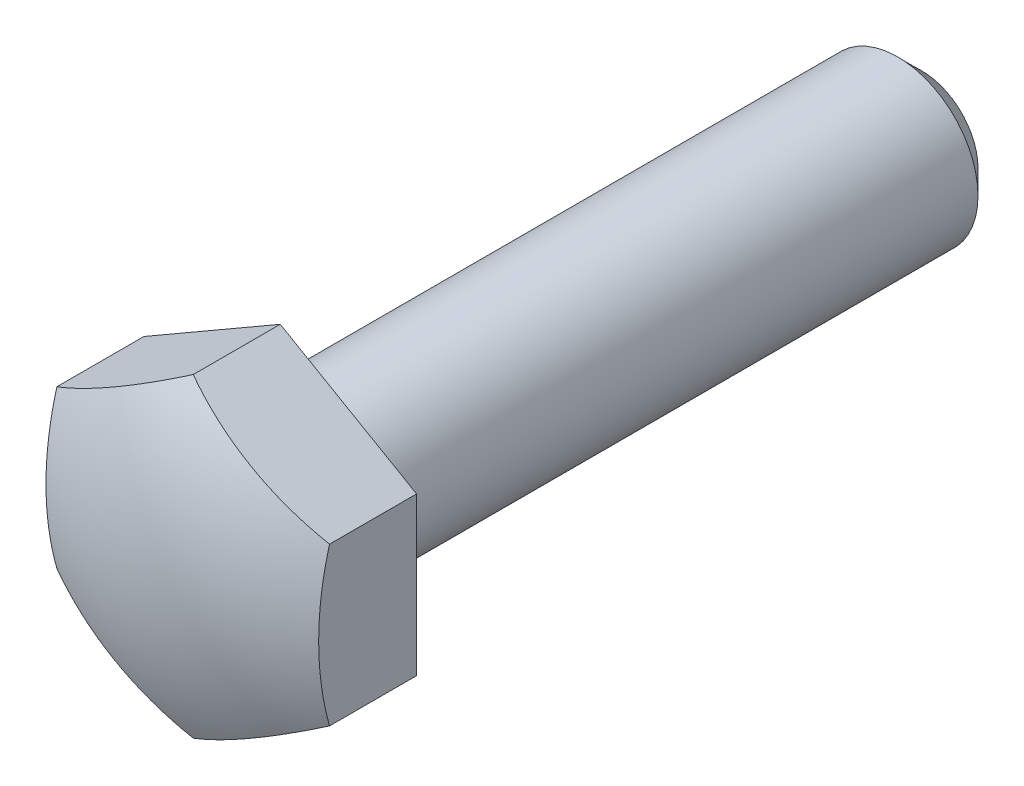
ISO-10303-21;
HEADER;
FILE_DESCRIPTION(('STEP AP214'),'2;1');
FILE_NAME('part.step','',(''),(''),'','','');
FILE_SCHEMA(('AUTOMOTIVE_DESIGN { 1 0 10303 214 1 1 1 1 }'));
ENDSEC;
DATA;
#1=APPLICATION_CONTEXT('core data for automotive mechanical design processes');
#2=APPLICATION_PROTOCOL_DEFINITION('international standard','automotive_design',2000,#1);
#3=PRODUCT_CONTEXT('',#1,'mechanical');
#4=PRODUCT('Part','Part','',(#3));
#5=PRODUCT_RELATED_PRODUCT_CATEGORY('part','',(#4));
#6=PRODUCT_DEFINITION_FORMATION('','',#4);
#7=PRODUCT_DEFINITION_CONTEXT('part definition',#1,'design');
#8=PRODUCT_DEFINITION('design','',#6,#7);
#9=PRODUCT_DEFINITION_SHAPE('','',#8);
#10=(LENGTH_UNIT() NAMED_UNIT(*) SI_UNIT(.MILLI.,.METRE.));
#11=(NAMED_UNIT(*) PLANE_ANGLE_UNIT() SI_UNIT($,.RADIAN.));
#12=(NAMED_UNIT(*) SI_UNIT($,.STERADIAN.) SOLID_ANGLE_UNIT());
#13=UNCERTAINTY_MEASURE_WITH_UNIT(LENGTH_MEASURE(1.E-05),#10,'distance_accuracy_value','');
#14=(GEOMETRIC_REPRESENTATION_CONTEXT(3) GLOBAL_UNCERTAINTY_ASSIGNED_CONTEXT((#13)) GLOBAL_UNIT_ASSIGNED_CONTEXT((#10,
#11,#12)) REPRESENTATION_CONTEXT('',''));
#15=CARTESIAN_POINT('',(0.,0.,0.));
#16=DIRECTION('',(0.,0.,1.));
#17=DIRECTION('',(1.,0.,0.));
#18=AXIS2_PLACEMENT_3D('',#15,#16,#17);
#19=CARTESIAN_POINT('',(5.,0.,0.));
#20=DIRECTION('',(0.,0.,1.));
#21=DIRECTION('',(1.,0.,0.));
#22=AXIS2_PLACEMENT_3D('',#19,#20,#21);
#23=PLANE('',#22);
#24=CARTESIAN_POINT('',(0.,0.,0.));
#25=DIRECTION('',(0.,0.,1.));
#26=DIRECTION('',(1.,0.,0.));
#27=AXIS2_PLACEMENT_3D('',#24,#25,#26);
#28=CIRCLE('',#27,5.);
#29=CARTESIAN_POINT('',(5.,0.,0.));
#30=VERTEX_POINT('',#29);
#31=EDGE_CURVE('E115',#30,#30,#28,.T.);
#32=ORIENTED_EDGE('',*,*,#31,.T.);
#33=EDGE_LOOP('',(#32));
#34=FACE_BOUND('',#33,.T.);
#35=DIRECTION('',(-0.86602540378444,-0.5,0.));
#36=VECTOR('',#35,1.);
#37=CARTESIAN_POINT('',(8.5,-4.90747728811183,0.));
#38=LINE('',#37,#36);
#39=CARTESIAN_POINT('',(8.5,-4.90747728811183,0.));
#40=VERTEX_POINT('',#39);
#41=CARTESIAN_POINT('',(0.,-9.81495457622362,0.));
#42=VERTEX_POINT('',#41);
#43=EDGE_CURVE('E89',#40,#42,#38,.T.);
#44=ORIENTED_EDGE('',*,*,#43,.T.);
#45=DIRECTION('',(0.86602540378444,-0.5,0.));
#46=VECTOR('',#45,1.);
#47=CARTESIAN_POINT('',(-8.5,-4.90747728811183,0.));
#48=LINE('',#47,#46);
#49=CARTESIAN_POINT('',(-8.5,-4.90747728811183,0.));
#50=VERTEX_POINT('',#49);
#51=EDGE_CURVE('E87',#50,#42,#48,.T.);
#52=ORIENTED_EDGE('',*,*,#51,.F.);
#53=DIRECTION('',(0.,-1.,0.));
#54=VECTOR('',#53,1.);
#55=CARTESIAN_POINT('',(-8.5,4.9074772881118,0.));
#56=LINE('',#55,#54);
#57=CARTESIAN_POINT('',(-8.5,4.9074772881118,0.));
#58=VERTEX_POINT('',#57);
#59=EDGE_CURVE('E37',#58,#50,#56,.T.);
#60=ORIENTED_EDGE('',*,*,#59,.F.);
#61=DIRECTION('',(0.866025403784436,0.5,0.));
#62=VECTOR('',#61,1.);
#63=CARTESIAN_POINT('',(-8.5,4.9074772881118,0.));
#64=LINE('',#63,#62);
#65=CARTESIAN_POINT('',(0.,9.81495457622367,0.));
#66=VERTEX_POINT('',#65);
#67=EDGE_CURVE('E77',#58,#66,#64,.T.);
#68=ORIENTED_EDGE('',*,*,#67,.T.);
#69=DIRECTION('',(-0.866025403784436,0.5,0.));
#70=VECTOR('',#69,1.);
#71=CARTESIAN_POINT('',(8.5,4.90747728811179,0.));
#72=LINE('',#71,#70);
#73=CARTESIAN_POINT('',(8.5,4.90747728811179,0.));
#74=VERTEX_POINT('',#73);
#75=EDGE_CURVE('E83',#74,#66,#72,.T.);
#76=ORIENTED_EDGE('',*,*,#75,.F.);
#77=DIRECTION('',(0.,-1.,0.));
#78=VECTOR('',#77,1.);
#79=CARTESIAN_POINT('',(8.5,4.90747728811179,0.));
#80=LINE('',#79,#78);
#81=EDGE_CURVE('E95',#74,#40,#80,.T.);
#82=ORIENTED_EDGE('',*,*,#81,.T.);
#83=EDGE_LOOP('',(#44,#52,#60,#68,#76,#82));
#84=FACE_BOUND('',#83,.T.);
#85=ADVANCED_FACE('F14',(#34,#84),#23,.F.);
#86=CARTESIAN_POINT('',(0.,0.,20.));
#87=DIRECTION('',(0.,0.,1.));
#88=DIRECTION('',(1.,0.,0.));
#89=AXIS2_PLACEMENT_3D('',#86,#87,#88);
#90=CYLINDRICAL_SURFACE('',#89,5.);
#91=CARTESIAN_POINT('',(0.,0.,-38.5));
#92=DIRECTION('',(0.,0.,1.));
#93=DIRECTION('',(1.,0.,0.));
#94=AXIS2_PLACEMENT_3D('',#91,#92,#93);
#95=CIRCLE('',#94,5.);
#96=CARTESIAN_POINT('',(5.,0.,-38.5));
#97=VERTEX_POINT('',#96);
#98=EDGE_CURVE('E22',#97,#97,#95,.T.);
#99=ORIENTED_EDGE('',*,*,#98,.T.);
#100=EDGE_LOOP('',(#99));
#101=FACE_BOUND('',#100,.T.);
#102=ORIENTED_EDGE('',*,*,#31,.F.);
#103=EDGE_LOOP('',(#102));
#104=FACE_BOUND('',#103,.T.);
#105=ADVANCED_FACE('F120',(#101,#104),#90,.T.);
#106=CARTESIAN_POINT('',(0.,0.,-40.));
#107=DIRECTION('',(0.,0.,1.));
#108=DIRECTION('',(1.,0.,0.));
#109=AXIS2_PLACEMENT_3D('',#106,#107,#108);
#110=PLANE('',#109);
#111=CARTESIAN_POINT('',(0.,0.,-40.));
#112=DIRECTION('',(0.,0.,1.));
#113=DIRECTION('',(1.,0.,0.));
#114=AXIS2_PLACEMENT_3D('',#111,#112,#113);
#115=CIRCLE('',#114,3.5);
#116=CARTESIAN_POINT('',(3.5,0.,-40.));
#117=VERTEX_POINT('',#116);
#118=EDGE_CURVE('E9',#117,#117,#115,.F.);
#119=ORIENTED_EDGE('',*,*,#118,.T.);
#120=EDGE_LOOP('',(#119));
#121=FACE_BOUND('',#120,.T.);
#122=ADVANCED_FACE('F141',(#121),#110,.F.);
#123=CARTESIAN_POINT('',(8.5,-4.90747728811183,8.));
#124=DIRECTION('',(0.5,-0.86602540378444,0.));
#125=DIRECTION('',(0.86602540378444,0.5,0.));
#126=AXIS2_PLACEMENT_3D('',#123,#124,#125);
#127=PLANE('',#126);
#128=DIRECTION('',(0.,0.,-1.));
#129=VECTOR('',#128,1.);
#130=CARTESIAN_POINT('',(0.,-9.81495457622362,8.));
#131=LINE('',#130,#129);
#132=CARTESIAN_POINT('',(0.,-9.81495457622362,5.426034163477));
#133=VERTEX_POINT('',#132);
#134=EDGE_CURVE('E29',#133,#42,#131,.T.);
#135=ORIENTED_EDGE('',*,*,#134,.T.);
#136=ORIENTED_EDGE('',*,*,#43,.F.);
#137=DIRECTION('',(0.,0.,-1.));
#138=VECTOR('',#137,1.);
#139=CARTESIAN_POINT('',(8.5,-4.90747728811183,8.));
#140=LINE('',#139,#138);
#141=CARTESIAN_POINT('',(8.5,-4.90747728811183,5.426034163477));
#142=VERTEX_POINT('',#141);
#143=EDGE_CURVE('E100',#142,#40,#140,.T.);
#144=ORIENTED_EDGE('',*,*,#143,.F.);
#145=CARTESIAN_POINT('',(4.25,-7.36121593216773,-12.));
#146=DIRECTION('',(0.5,-0.86602540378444,0.));
#147=DIRECTION('',(0.86602540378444,0.5,0.));
#148=AXIS2_PLACEMENT_3D('',#145,#146,#147);
#149=CIRCLE('',#148,18.1038669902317);
#150=EDGE_CURVE('E112',#133,#142,#149,.F.);
#151=ORIENTED_EDGE('',*,*,#150,.F.);
#152=EDGE_LOOP('',(#135,#136,#144,#151));
#153=FACE_BOUND('',#152,.T.);
#154=ADVANCED_FACE('F146',(#153),#127,.T.);
#155=CARTESIAN_POINT('',(8.5,4.90747728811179,8.));
#156=DIRECTION('',(1.,0.,0.));
#157=DIRECTION('',(0.,0.,-1.));
#158=AXIS2_PLACEMENT_3D('',#155,#156,#157);
#159=PLANE('',#158);
#160=ORIENTED_EDGE('',*,*,#143,.T.);
#161=ORIENTED_EDGE('',*,*,#81,.F.);
#162=DIRECTION('',(0.,0.,-1.));
#163=VECTOR('',#162,1.);
#164=CARTESIAN_POINT('',(8.5,4.90747728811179,8.));
#165=LINE('',#164,#163);
#166=CARTESIAN_POINT('',(8.5,4.90747728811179,5.426034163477));
#167=VERTEX_POINT('',#166);
#168=EDGE_CURVE('E98',#167,#74,#165,.T.);
#169=ORIENTED_EDGE('',*,*,#168,.F.);
#170=CARTESIAN_POINT('',(8.5,0.,-12.));
#171=DIRECTION('',(1.,0.,0.));
#172=DIRECTION('',(0.,0.,-1.));
#173=AXIS2_PLACEMENT_3D('',#170,#171,#172);
#174=CIRCLE('',#173,18.1038669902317);
#175=EDGE_CURVE('E109',#142,#167,#174,.F.);
#176=ORIENTED_EDGE('',*,*,#175,.F.);
#177=EDGE_LOOP('',(#160,#161,#169,#176));
#178=FACE_BOUND('',#177,.T.);
#179=ADVANCED_FACE('F148',(#178),#159,.T.);
#180=CARTESIAN_POINT('',(8.5,4.90747728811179,8.));
#181=DIRECTION('',(-0.5,-0.866025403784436,0.));
#182=DIRECTION('',(0.866025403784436,-0.5,0.));
#183=AXIS2_PLACEMENT_3D('',#180,#181,#182);
#184=PLANE('',#183);
#185=CARTESIAN_POINT('',(4.25,7.36121593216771,-12.));
#186=DIRECTION('',(-0.5,-0.866025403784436,0.));
#187=DIRECTION('',(0.866025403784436,-0.5,0.));
#188=AXIS2_PLACEMENT_3D('',#185,#186,#187);
#189=CIRCLE('',#188,18.1038669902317);
#190=CARTESIAN_POINT('',(0.,9.81495457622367,5.426034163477));
#191=VERTEX_POINT('',#190);
#192=EDGE_CURVE('E107',#191,#167,#189,.F.);
#193=ORIENTED_EDGE('',*,*,#192,.T.);
#194=ORIENTED_EDGE('',*,*,#168,.T.);
#195=ORIENTED_EDGE('',*,*,#75,.T.);
#196=DIRECTION('',(0.,0.,-1.));
#197=VECTOR('',#196,1.);
#198=CARTESIAN_POINT('',(0.,9.81495457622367,8.));
#199=LINE('',#198,#197);
#200=EDGE_CURVE('E73',#191,#66,#199,.T.);
#201=ORIENTED_EDGE('',*,*,#200,.F.);
#202=EDGE_LOOP('',(#193,#194,#195,#201));
#203=FACE_BOUND('',#202,.T.);
#204=ADVANCED_FACE('F151',(#203),#184,.F.);
#205=CARTESIAN_POINT('',(-8.5,4.9074772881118,8.));
#206=DIRECTION('',(-0.5,0.866025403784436,0.));
#207=DIRECTION('',(-0.866025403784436,-0.5,0.));
#208=AXIS2_PLACEMENT_3D('',#205,#206,#207);
#209=PLANE('',#208);
#210=ORIENTED_EDGE('',*,*,#200,.T.);
#211=ORIENTED_EDGE('',*,*,#67,.F.);
#212=DIRECTION('',(0.,0.,-1.));
#213=VECTOR('',#212,1.);
#214=CARTESIAN_POINT('',(-8.5,4.9074772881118,8.));
#215=LINE('',#214,#213);
#216=CARTESIAN_POINT('',(-8.5,4.9074772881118,5.426034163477));
#217=VERTEX_POINT('',#216);
#218=EDGE_CURVE('E66',#217,#58,#215,.T.);
#219=ORIENTED_EDGE('',*,*,#218,.F.);
#220=CARTESIAN_POINT('',(-4.25,7.36121593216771,-12.));
#221=DIRECTION('',(-0.5,0.866025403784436,0.));
#222=DIRECTION('',(-0.866025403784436,-0.5,0.));
#223=AXIS2_PLACEMENT_3D('',#220,#221,#222);
#224=CIRCLE('',#223,18.1038669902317);
#225=EDGE_CURVE('E105',#191,#217,#224,.F.);
#226=ORIENTED_EDGE('',*,*,#225,.F.);
#227=EDGE_LOOP('',(#210,#211,#219,#226));
#228=FACE_BOUND('',#227,.T.);
#229=ADVANCED_FACE('F78',(#228),#209,.T.);
#230=CARTESIAN_POINT('',(-8.5,4.9074772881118,8.));
#231=DIRECTION('',(1.,0.,0.));
#232=DIRECTION('',(0.,1.,0.));
#233=AXIS2_PLACEMENT_3D('',#230,#231,#232);
#234=PLANE('',#233);
#235=CARTESIAN_POINT('',(-8.5,0.,-12.));
#236=DIRECTION('',(1.,0.,0.));
#237=DIRECTION('',(0.,1.,0.));
#238=AXIS2_PLACEMENT_3D('',#235,#236,#237);
#239=CIRCLE('',#238,18.1038669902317);
#240=CARTESIAN_POINT('',(-8.5,-4.90747728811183,5.426034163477));
#241=VERTEX_POINT('',#240);
#242=EDGE_CURVE('E70',#241,#217,#239,.F.);
#243=ORIENTED_EDGE('',*,*,#242,.T.);
#244=ORIENTED_EDGE('',*,*,#218,.T.);
#245=ORIENTED_EDGE('',*,*,#59,.T.);
#246=DIRECTION('',(0.,0.,-1.));
#247=VECTOR('',#246,1.);
#248=CARTESIAN_POINT('',(-8.5,-4.90747728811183,8.));
#249=LINE('',#248,#247);
#250=EDGE_CURVE('E74',#241,#50,#249,.T.);
#251=ORIENTED_EDGE('',*,*,#250,.F.);
#252=EDGE_LOOP('',(#243,#244,#245,#251));
#253=FACE_BOUND('',#252,.T.);
#254=ADVANCED_FACE('F68',(#253),#234,.F.);
#255=CARTESIAN_POINT('',(-8.5,-4.90747728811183,8.));
#256=DIRECTION('',(0.5,0.86602540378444,0.));
#257=DIRECTION('',(-0.86602540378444,0.5,0.));
#258=AXIS2_PLACEMENT_3D('',#255,#256,#257);
#259=PLANE('',#258);
#260=CARTESIAN_POINT('',(-4.25,-7.36121593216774,-12.));
#261=DIRECTION('',(0.5,0.86602540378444,0.));
#262=DIRECTION('',(-0.86602540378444,0.5,0.));
#263=AXIS2_PLACEMENT_3D('',#260,#261,#262);
#264=CIRCLE('',#263,18.1038669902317);
#265=EDGE_CURVE('E102',#133,#241,#264,.F.);
#266=ORIENTED_EDGE('',*,*,#265,.T.);
#267=ORIENTED_EDGE('',*,*,#250,.T.);
#268=ORIENTED_EDGE('',*,*,#51,.T.);
#269=ORIENTED_EDGE('',*,*,#134,.F.);
#270=EDGE_LOOP('',(#266,#267,#268,#269));
#271=FACE_BOUND('',#270,.T.);
#272=ADVANCED_FACE('F131',(#271),#259,.F.);
#273=CARTESIAN_POINT('',(0.,0.,-12.));
#274=DIRECTION('',(0.,0.,1.));
#275=DIRECTION('',(1.,0.,0.));
#276=AXIS2_PLACEMENT_3D('',#273,#274,#275);
#277=SPHERICAL_SURFACE('',#276,20.);
#278=ORIENTED_EDGE('',*,*,#265,.F.);
#279=ORIENTED_EDGE('',*,*,#150,.T.);
#280=ORIENTED_EDGE('',*,*,#175,.T.);
#281=ORIENTED_EDGE('',*,*,#192,.F.);
#282=ORIENTED_EDGE('',*,*,#225,.T.);
#283=ORIENTED_EDGE('',*,*,#242,.F.);
#284=EDGE_LOOP('',(#278,#279,#280,#281,#282,#283));
#285=FACE_BOUND('',#284,.T.);
#286=ADVANCED_FACE('F124',(#285),#277,.T.);
#287=CARTESIAN_POINT('',(0.,0.,-38.5));
#288=DIRECTION('',(0.,0.,1.));
#289=DIRECTION('',(1.,0.,0.));
#290=AXIS2_PLACEMENT_3D('',#287,#288,#289);
#291=CONICAL_SURFACE('',#290,5.,0.785398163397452);
#292=ORIENTED_EDGE('',*,*,#118,.F.);
#293=EDGE_LOOP('',(#292));
#294=FACE_BOUND('',#293,.T.);
#295=ORIENTED_EDGE('',*,*,#98,.F.);
#296=EDGE_LOOP('',(#295));
#297=FACE_BOUND('',#296,.T.);
#298=ADVANCED_FACE('F16',(#294,#297),#291,.T.);
#299=CLOSED_SHELL('',(#85,#105,#122,#154,#179,#204,#229,#254,#272,#286,#298));
#300=MANIFOLD_SOLID_BREP('B1',#299);
#301=ADVANCED_BREP_SHAPE_REPRESENTATION('',(#18,#300),#14);
#302=SHAPE_DEFINITION_REPRESENTATION(#9,#301);
ENDSEC;
END-ISO-10303-21;
